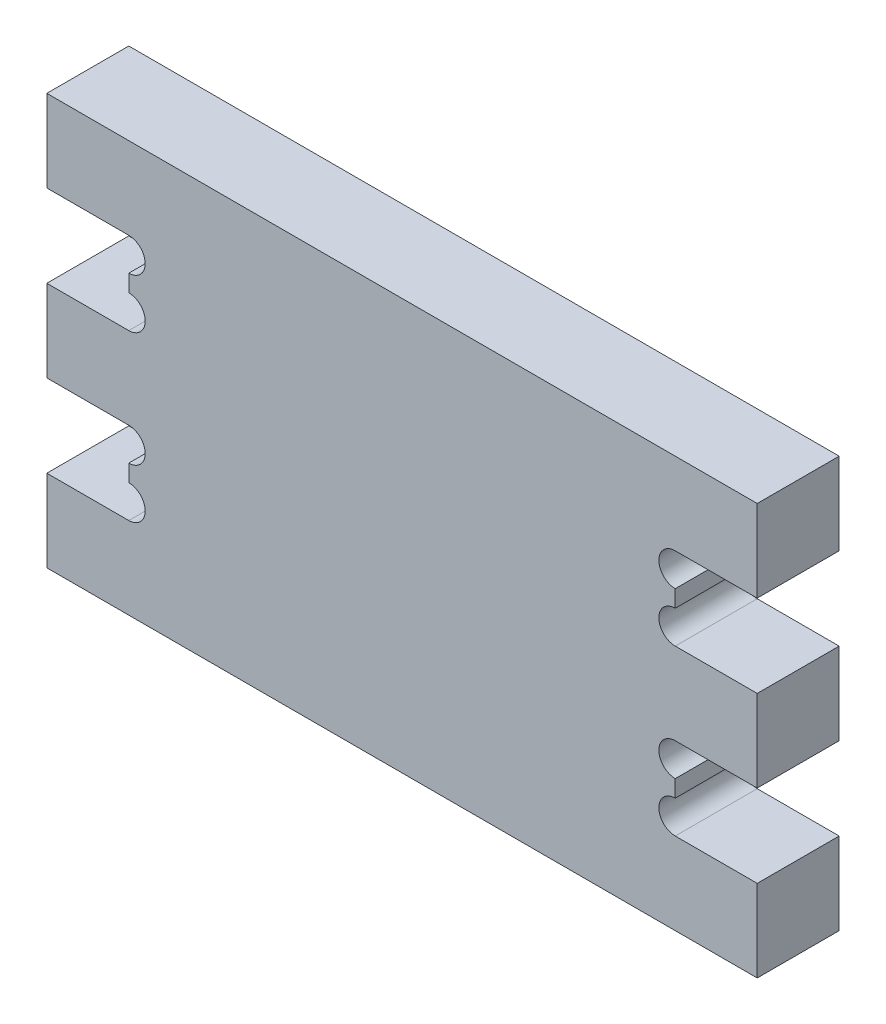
ISO-10303-21;
HEADER;
FILE_DESCRIPTION(('STEP AP214'),'2;1');
FILE_NAME('part.step','',(''),(''),'','','');
FILE_SCHEMA(('AUTOMOTIVE_DESIGN { 1 0 10303 214 1 1 1 1 }'));
ENDSEC;
DATA;
#1=APPLICATION_CONTEXT('core data for automotive mechanical design processes');
#2=APPLICATION_PROTOCOL_DEFINITION('international standard','automotive_design',2000,#1);
#3=PRODUCT_CONTEXT('',#1,'mechanical');
#4=PRODUCT('Part','Part','',(#3));
#5=PRODUCT_RELATED_PRODUCT_CATEGORY('part','',(#4));
#6=PRODUCT_DEFINITION_FORMATION('','',#4);
#7=PRODUCT_DEFINITION_CONTEXT('part definition',#1,'design');
#8=PRODUCT_DEFINITION('design','',#6,#7);
#9=PRODUCT_DEFINITION_SHAPE('','',#8);
#10=(LENGTH_UNIT() NAMED_UNIT(*) SI_UNIT(.MILLI.,.METRE.));
#11=(NAMED_UNIT(*) PLANE_ANGLE_UNIT() SI_UNIT($,.RADIAN.));
#12=(NAMED_UNIT(*) SI_UNIT($,.STERADIAN.) SOLID_ANGLE_UNIT());
#13=UNCERTAINTY_MEASURE_WITH_UNIT(LENGTH_MEASURE(1.E-05),#10,'distance_accuracy_value','');
#14=(GEOMETRIC_REPRESENTATION_CONTEXT(3) GLOBAL_UNCERTAINTY_ASSIGNED_CONTEXT((#13)) GLOBAL_UNIT_ASSIGNED_CONTEXT((#10,
#11,#12)) REPRESENTATION_CONTEXT('',''));
#15=CARTESIAN_POINT('',(0.,0.,0.));
#16=DIRECTION('',(0.,0.,1.));
#17=DIRECTION('',(1.,0.,0.));
#18=AXIS2_PLACEMENT_3D('',#15,#16,#17);
#19=CARTESIAN_POINT('',(0.,82.6,15.));
#20=DIRECTION('',(1.,0.,0.));
#21=DIRECTION('',(0.,1.,0.));
#22=AXIS2_PLACEMENT_3D('',#19,#20,#21);
#23=PLANE('',#22);
#24=DIRECTION('',(0.,-1.,0.));
#25=VECTOR('',#24,1.);
#26=CARTESIAN_POINT('',(0.,82.6,0.));
#27=LINE('',#26,#25);
#28=CARTESIAN_POINT('',(0.,82.6,0.));
#29=VERTEX_POINT('',#28);
#30=CARTESIAN_POINT('',(0.,67.6,0.));
#31=VERTEX_POINT('',#30);
#32=EDGE_CURVE('E258',#29,#31,#27,.T.);
#33=ORIENTED_EDGE('',*,*,#32,.T.);
#34=DIRECTION('',(0.,0.,-1.));
#35=VECTOR('',#34,1.);
#36=CARTESIAN_POINT('',(0.,67.6,15.));
#37=LINE('',#36,#35);
#38=CARTESIAN_POINT('',(0.,67.6,15.));
#39=VERTEX_POINT('',#38);
#40=EDGE_CURVE('E45',#39,#31,#37,.T.);
#41=ORIENTED_EDGE('',*,*,#40,.F.);
#42=DIRECTION('',(0.,-1.,0.));
#43=VECTOR('',#42,1.);
#44=CARTESIAN_POINT('',(0.,82.6,15.));
#45=LINE('',#44,#43);
#46=CARTESIAN_POINT('',(0.,82.6,15.));
#47=VERTEX_POINT('',#46);
#48=EDGE_CURVE('E158',#47,#39,#45,.T.);
#49=ORIENTED_EDGE('',*,*,#48,.F.);
#50=DIRECTION('',(0.,0.,-1.));
#51=VECTOR('',#50,1.);
#52=CARTESIAN_POINT('',(0.,82.6,15.));
#53=LINE('',#52,#51);
#54=EDGE_CURVE('E11',#47,#29,#53,.T.);
#55=ORIENTED_EDGE('',*,*,#54,.T.);
#56=EDGE_LOOP('',(#33,#41,#49,#55));
#57=FACE_BOUND('',#56,.T.);
#58=ADVANCED_FACE('F37',(#57),#23,.F.);
#59=CARTESIAN_POINT('',(0.,67.6,15.));
#60=DIRECTION('',(0.,1.,0.));
#61=DIRECTION('',(-1.,0.,0.));
#62=AXIS2_PLACEMENT_3D('',#59,#60,#61);
#63=PLANE('',#62);
#64=DIRECTION('',(1.,0.,0.));
#65=VECTOR('',#64,1.);
#66=CARTESIAN_POINT('',(0.,67.6,0.));
#67=LINE('',#66,#65);
#68=CARTESIAN_POINT('',(15.,67.6,0.));
#69=VERTEX_POINT('',#68);
#70=EDGE_CURVE('E260',#31,#69,#67,.T.);
#71=ORIENTED_EDGE('',*,*,#70,.T.);
#72=DIRECTION('',(0.,0.,-1.));
#73=VECTOR('',#72,1.);
#74=CARTESIAN_POINT('',(15.,67.6,15.));
#75=LINE('',#74,#73);
#76=CARTESIAN_POINT('',(15.,67.6,15.));
#77=VERTEX_POINT('',#76);
#78=EDGE_CURVE('E378',#77,#69,#75,.T.);
#79=ORIENTED_EDGE('',*,*,#78,.F.);
#80=DIRECTION('',(1.,0.,0.));
#81=VECTOR('',#80,1.);
#82=CARTESIAN_POINT('',(0.,67.6,15.));
#83=LINE('',#82,#81);
#84=EDGE_CURVE('E386',#39,#77,#83,.T.);
#85=ORIENTED_EDGE('',*,*,#84,.F.);
#86=ORIENTED_EDGE('',*,*,#40,.T.);
#87=EDGE_LOOP('',(#71,#79,#85,#86));
#88=FACE_BOUND('',#87,.T.);
#89=ADVANCED_FACE('F384',(#88),#63,.F.);
#90=CARTESIAN_POINT('',(15.,64.6,15.));
#91=DIRECTION('',(0.,0.,-1.));
#92=DIRECTION('',(-1.,0.,0.));
#93=AXIS2_PLACEMENT_3D('',#90,#91,#92);
#94=CYLINDRICAL_SURFACE('',#93,3.);
#95=CARTESIAN_POINT('',(15.,64.6,0.));
#96=DIRECTION('',(0.,0.,-1.));
#97=DIRECTION('',(-1.,0.,0.));
#98=AXIS2_PLACEMENT_3D('',#95,#96,#97);
#99=CIRCLE('',#98,3.);
#100=CARTESIAN_POINT('',(15.,61.6,0.));
#101=VERTEX_POINT('',#100);
#102=EDGE_CURVE('E262',#69,#101,#99,.T.);
#103=ORIENTED_EDGE('',*,*,#102,.T.);
#104=DIRECTION('',(0.,0.,-1.));
#105=VECTOR('',#104,1.);
#106=CARTESIAN_POINT('',(15.,61.6,15.));
#107=LINE('',#106,#105);
#108=CARTESIAN_POINT('',(15.,61.6,15.));
#109=VERTEX_POINT('',#108);
#110=EDGE_CURVE('E375',#109,#101,#107,.T.);
#111=ORIENTED_EDGE('',*,*,#110,.F.);
#112=CARTESIAN_POINT('',(15.,64.6,15.));
#113=DIRECTION('',(0.,0.,-1.));
#114=DIRECTION('',(-1.,0.,0.));
#115=AXIS2_PLACEMENT_3D('',#112,#113,#114);
#116=CIRCLE('',#115,3.);
#117=EDGE_CURVE('E402',#77,#109,#116,.T.);
#118=ORIENTED_EDGE('',*,*,#117,.F.);
#119=ORIENTED_EDGE('',*,*,#78,.T.);
#120=EDGE_LOOP('',(#103,#111,#118,#119));
#121=FACE_BOUND('',#120,.T.);
#122=ADVANCED_FACE('F393',(#121),#94,.F.);
#123=CARTESIAN_POINT('',(15.,61.6,15.));
#124=DIRECTION('',(1.,0.,0.));
#125=DIRECTION('',(0.,1.,0.));
#126=AXIS2_PLACEMENT_3D('',#123,#124,#125);
#127=PLANE('',#126);
#128=DIRECTION('',(0.,-1.,0.));
#129=VECTOR('',#128,1.);
#130=CARTESIAN_POINT('',(15.,61.6,0.));
#131=LINE('',#130,#129);
#132=CARTESIAN_POINT('',(15.,58.5,0.));
#133=VERTEX_POINT('',#132);
#134=EDGE_CURVE('E264',#101,#133,#131,.T.);
#135=ORIENTED_EDGE('',*,*,#134,.T.);
#136=DIRECTION('',(0.,0.,-1.));
#137=VECTOR('',#136,1.);
#138=CARTESIAN_POINT('',(15.,58.5,15.));
#139=LINE('',#138,#137);
#140=CARTESIAN_POINT('',(15.,58.5,15.));
#141=VERTEX_POINT('',#140);
#142=EDGE_CURVE('E372',#141,#133,#139,.T.);
#143=ORIENTED_EDGE('',*,*,#142,.F.);
#144=DIRECTION('',(0.,-1.,0.));
#145=VECTOR('',#144,1.);
#146=CARTESIAN_POINT('',(15.,61.6,15.));
#147=LINE('',#146,#145);
#148=EDGE_CURVE('E399',#109,#141,#147,.T.);
#149=ORIENTED_EDGE('',*,*,#148,.F.);
#150=ORIENTED_EDGE('',*,*,#110,.T.);
#151=EDGE_LOOP('',(#135,#143,#149,#150));
#152=FACE_BOUND('',#151,.T.);
#153=ADVANCED_FACE('F397',(#152),#127,.F.);
#154=CARTESIAN_POINT('',(15.,55.5,15.));
#155=DIRECTION('',(0.,0.,-1.));
#156=DIRECTION('',(-1.,0.,0.));
#157=AXIS2_PLACEMENT_3D('',#154,#155,#156);
#158=CYLINDRICAL_SURFACE('',#157,3.00000000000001);
#159=CARTESIAN_POINT('',(15.,55.5,0.));
#160=DIRECTION('',(0.,0.,-1.));
#161=DIRECTION('',(-1.,0.,0.));
#162=AXIS2_PLACEMENT_3D('',#159,#160,#161);
#163=CIRCLE('',#162,3.00000000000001);
#164=CARTESIAN_POINT('',(15.,52.5,0.));
#165=VERTEX_POINT('',#164);
#166=EDGE_CURVE('E266',#133,#165,#163,.T.);
#167=ORIENTED_EDGE('',*,*,#166,.T.);
#168=DIRECTION('',(0.,0.,-1.));
#169=VECTOR('',#168,1.);
#170=CARTESIAN_POINT('',(15.,52.5,15.));
#171=LINE('',#170,#169);
#172=CARTESIAN_POINT('',(15.,52.5,15.));
#173=VERTEX_POINT('',#172);
#174=EDGE_CURVE('E369',#173,#165,#171,.T.);
#175=ORIENTED_EDGE('',*,*,#174,.F.);
#176=CARTESIAN_POINT('',(15.,55.5,15.));
#177=DIRECTION('',(0.,0.,-1.));
#178=DIRECTION('',(-1.,0.,0.));
#179=AXIS2_PLACEMENT_3D('',#176,#177,#178);
#180=CIRCLE('',#179,3.00000000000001);
#181=EDGE_CURVE('E401',#141,#173,#180,.T.);
#182=ORIENTED_EDGE('',*,*,#181,.F.);
#183=ORIENTED_EDGE('',*,*,#142,.T.);
#184=EDGE_LOOP('',(#167,#175,#182,#183));
#185=FACE_BOUND('',#184,.T.);
#186=ADVANCED_FACE('F468',(#185),#158,.F.);
#187=CARTESIAN_POINT('',(15.,52.5,15.));
#188=DIRECTION('',(0.,-1.,0.));
#189=DIRECTION('',(0.,0.,-1.));
#190=AXIS2_PLACEMENT_3D('',#187,#188,#189);
#191=PLANE('',#190);
#192=DIRECTION('',(-1.,0.,0.));
#193=VECTOR('',#192,1.);
#194=CARTESIAN_POINT('',(15.,52.5,0.));
#195=LINE('',#194,#193);
#196=CARTESIAN_POINT('',(0.,52.5,0.));
#197=VERTEX_POINT('',#196);
#198=EDGE_CURVE('E268',#165,#197,#195,.T.);
#199=ORIENTED_EDGE('',*,*,#198,.T.);
#200=DIRECTION('',(0.,0.,-1.));
#201=VECTOR('',#200,1.);
#202=CARTESIAN_POINT('',(0.,52.5,15.));
#203=LINE('',#202,#201);
#204=CARTESIAN_POINT('',(0.,52.5,15.));
#205=VERTEX_POINT('',#204);
#206=EDGE_CURVE('E366',#205,#197,#203,.T.);
#207=ORIENTED_EDGE('',*,*,#206,.F.);
#208=DIRECTION('',(-1.,0.,0.));
#209=VECTOR('',#208,1.);
#210=CARTESIAN_POINT('',(15.,52.5,15.));
#211=LINE('',#210,#209);
#212=EDGE_CURVE('E404',#173,#205,#211,.T.);
#213=ORIENTED_EDGE('',*,*,#212,.F.);
#214=ORIENTED_EDGE('',*,*,#174,.T.);
#215=EDGE_LOOP('',(#199,#207,#213,#214));
#216=FACE_BOUND('',#215,.T.);
#217=ADVANCED_FACE('F471',(#216),#191,.F.);
#218=CARTESIAN_POINT('',(0.,52.5,15.));
#219=DIRECTION('',(1.,0.,0.));
#220=DIRECTION('',(0.,1.,0.));
#221=AXIS2_PLACEMENT_3D('',#218,#219,#220);
#222=PLANE('',#221);
#223=DIRECTION('',(0.,-1.,0.));
#224=VECTOR('',#223,1.);
#225=CARTESIAN_POINT('',(0.,52.5,0.));
#226=LINE('',#225,#224);
#227=CARTESIAN_POINT('',(0.,37.5,0.));
#228=VERTEX_POINT('',#227);
#229=EDGE_CURVE('E270',#197,#228,#226,.T.);
#230=ORIENTED_EDGE('',*,*,#229,.T.);
#231=DIRECTION('',(0.,0.,-1.));
#232=VECTOR('',#231,1.);
#233=CARTESIAN_POINT('',(0.,37.5,15.));
#234=LINE('',#233,#232);
#235=CARTESIAN_POINT('',(0.,37.5,15.));
#236=VERTEX_POINT('',#235);
#237=EDGE_CURVE('E363',#236,#228,#234,.T.);
#238=ORIENTED_EDGE('',*,*,#237,.F.);
#239=DIRECTION('',(0.,-1.,0.));
#240=VECTOR('',#239,1.);
#241=CARTESIAN_POINT('',(0.,52.5,15.));
#242=LINE('',#241,#240);
#243=EDGE_CURVE('E410',#205,#236,#242,.T.);
#244=ORIENTED_EDGE('',*,*,#243,.F.);
#245=ORIENTED_EDGE('',*,*,#206,.T.);
#246=EDGE_LOOP('',(#230,#238,#244,#245));
#247=FACE_BOUND('',#246,.T.);
#248=ADVANCED_FACE('F475',(#247),#222,.F.);
#249=CARTESIAN_POINT('',(0.,37.5,15.));
#250=DIRECTION('',(0.,1.,0.));
#251=DIRECTION('',(-1.,0.,0.));
#252=AXIS2_PLACEMENT_3D('',#249,#250,#251);
#253=PLANE('',#252);
#254=DIRECTION('',(1.,0.,0.));
#255=VECTOR('',#254,1.);
#256=CARTESIAN_POINT('',(0.,37.5,0.));
#257=LINE('',#256,#255);
#258=CARTESIAN_POINT('',(15.,37.5,0.));
#259=VERTEX_POINT('',#258);
#260=EDGE_CURVE('E272',#228,#259,#257,.T.);
#261=ORIENTED_EDGE('',*,*,#260,.T.);
#262=DIRECTION('',(0.,0.,-1.));
#263=VECTOR('',#262,1.);
#264=CARTESIAN_POINT('',(15.,37.5,15.));
#265=LINE('',#264,#263);
#266=CARTESIAN_POINT('',(15.,37.5,15.));
#267=VERTEX_POINT('',#266);
#268=EDGE_CURVE('E360',#267,#259,#265,.T.);
#269=ORIENTED_EDGE('',*,*,#268,.F.);
#270=DIRECTION('',(1.,0.,0.));
#271=VECTOR('',#270,1.);
#272=CARTESIAN_POINT('',(0.,37.5,15.));
#273=LINE('',#272,#271);
#274=EDGE_CURVE('E412',#236,#267,#273,.T.);
#275=ORIENTED_EDGE('',*,*,#274,.F.);
#276=ORIENTED_EDGE('',*,*,#237,.T.);
#277=EDGE_LOOP('',(#261,#269,#275,#276));
#278=FACE_BOUND('',#277,.T.);
#279=ADVANCED_FACE('F479',(#278),#253,.F.);
#280=CARTESIAN_POINT('',(15.,34.5,15.));
#281=DIRECTION('',(0.,0.,-1.));
#282=DIRECTION('',(-1.,0.,0.));
#283=AXIS2_PLACEMENT_3D('',#280,#281,#282);
#284=CYLINDRICAL_SURFACE('',#283,3.);
#285=CARTESIAN_POINT('',(15.,34.5,0.));
#286=DIRECTION('',(0.,0.,-1.));
#287=DIRECTION('',(-1.,0.,0.));
#288=AXIS2_PLACEMENT_3D('',#285,#286,#287);
#289=CIRCLE('',#288,3.);
#290=CARTESIAN_POINT('',(15.,31.5,0.));
#291=VERTEX_POINT('',#290);
#292=EDGE_CURVE('E274',#259,#291,#289,.T.);
#293=ORIENTED_EDGE('',*,*,#292,.T.);
#294=DIRECTION('',(0.,0.,-1.));
#295=VECTOR('',#294,1.);
#296=CARTESIAN_POINT('',(15.,31.5,15.));
#297=LINE('',#296,#295);
#298=CARTESIAN_POINT('',(15.,31.5,15.));
#299=VERTEX_POINT('',#298);
#300=EDGE_CURVE('E357',#299,#291,#297,.T.);
#301=ORIENTED_EDGE('',*,*,#300,.F.);
#302=CARTESIAN_POINT('',(15.,34.5,15.));
#303=DIRECTION('',(0.,0.,-1.));
#304=DIRECTION('',(-1.,0.,0.));
#305=AXIS2_PLACEMENT_3D('',#302,#303,#304);
#306=CIRCLE('',#305,3.);
#307=EDGE_CURVE('E414',#267,#299,#306,.T.);
#308=ORIENTED_EDGE('',*,*,#307,.F.);
#309=ORIENTED_EDGE('',*,*,#268,.T.);
#310=EDGE_LOOP('',(#293,#301,#308,#309));
#311=FACE_BOUND('',#310,.T.);
#312=ADVANCED_FACE('F483',(#311),#284,.F.);
#313=CARTESIAN_POINT('',(15.,31.5,15.));
#314=DIRECTION('',(1.,0.,0.));
#315=DIRECTION('',(0.,1.,0.));
#316=AXIS2_PLACEMENT_3D('',#313,#314,#315);
#317=PLANE('',#316);
#318=DIRECTION('',(0.,-1.,0.));
#319=VECTOR('',#318,1.);
#320=CARTESIAN_POINT('',(15.,31.5,0.));
#321=LINE('',#320,#319);
#322=CARTESIAN_POINT('',(15.,28.4,0.));
#323=VERTEX_POINT('',#322);
#324=EDGE_CURVE('E276',#291,#323,#321,.T.);
#325=ORIENTED_EDGE('',*,*,#324,.T.);
#326=DIRECTION('',(0.,0.,-1.));
#327=VECTOR('',#326,1.);
#328=CARTESIAN_POINT('',(15.,28.4,15.));
#329=LINE('',#328,#327);
#330=CARTESIAN_POINT('',(15.,28.4,15.));
#331=VERTEX_POINT('',#330);
#332=EDGE_CURVE('E354',#331,#323,#329,.T.);
#333=ORIENTED_EDGE('',*,*,#332,.F.);
#334=DIRECTION('',(0.,-1.,0.));
#335=VECTOR('',#334,1.);
#336=CARTESIAN_POINT('',(15.,31.5,15.));
#337=LINE('',#336,#335);
#338=EDGE_CURVE('E416',#299,#331,#337,.T.);
#339=ORIENTED_EDGE('',*,*,#338,.F.);
#340=ORIENTED_EDGE('',*,*,#300,.T.);
#341=EDGE_LOOP('',(#325,#333,#339,#340));
#342=FACE_BOUND('',#341,.T.);
#343=ADVANCED_FACE('F487',(#342),#317,.F.);
#344=CARTESIAN_POINT('',(15.,25.4,15.));
#345=DIRECTION('',(0.,0.,-1.));
#346=DIRECTION('',(-1.,0.,0.));
#347=AXIS2_PLACEMENT_3D('',#344,#345,#346);
#348=CYLINDRICAL_SURFACE('',#347,3.);
#349=CARTESIAN_POINT('',(15.,25.4,0.));
#350=DIRECTION('',(0.,0.,-1.));
#351=DIRECTION('',(-1.,0.,0.));
#352=AXIS2_PLACEMENT_3D('',#349,#350,#351);
#353=CIRCLE('',#352,3.);
#354=CARTESIAN_POINT('',(15.,22.4,0.));
#355=VERTEX_POINT('',#354);
#356=EDGE_CURVE('E278',#323,#355,#353,.T.);
#357=ORIENTED_EDGE('',*,*,#356,.T.);
#358=DIRECTION('',(0.,0.,-1.));
#359=VECTOR('',#358,1.);
#360=CARTESIAN_POINT('',(15.,22.4,15.));
#361=LINE('',#360,#359);
#362=CARTESIAN_POINT('',(15.,22.4,15.));
#363=VERTEX_POINT('',#362);
#364=EDGE_CURVE('E351',#363,#355,#361,.T.);
#365=ORIENTED_EDGE('',*,*,#364,.F.);
#366=CARTESIAN_POINT('',(15.,25.4,15.));
#367=DIRECTION('',(0.,0.,-1.));
#368=DIRECTION('',(-1.,0.,0.));
#369=AXIS2_PLACEMENT_3D('',#366,#367,#368);
#370=CIRCLE('',#369,3.);
#371=EDGE_CURVE('E418',#331,#363,#370,.T.);
#372=ORIENTED_EDGE('',*,*,#371,.F.);
#373=ORIENTED_EDGE('',*,*,#332,.T.);
#374=EDGE_LOOP('',(#357,#365,#372,#373));
#375=FACE_BOUND('',#374,.T.);
#376=ADVANCED_FACE('F491',(#375),#348,.F.);
#377=CARTESIAN_POINT('',(15.,22.4,15.));
#378=DIRECTION('',(0.,-1.,0.));
#379=DIRECTION('',(1.,0.,0.));
#380=AXIS2_PLACEMENT_3D('',#377,#378,#379);
#381=PLANE('',#380);
#382=DIRECTION('',(-1.,0.,0.));
#383=VECTOR('',#382,1.);
#384=CARTESIAN_POINT('',(15.,22.4,0.));
#385=LINE('',#384,#383);
#386=CARTESIAN_POINT('',(0.,22.4,0.));
#387=VERTEX_POINT('',#386);
#388=EDGE_CURVE('E280',#355,#387,#385,.T.);
#389=ORIENTED_EDGE('',*,*,#388,.T.);
#390=DIRECTION('',(0.,0.,-1.));
#391=VECTOR('',#390,1.);
#392=CARTESIAN_POINT('',(0.,22.4,15.));
#393=LINE('',#392,#391);
#394=CARTESIAN_POINT('',(0.,22.4,15.));
#395=VERTEX_POINT('',#394);
#396=EDGE_CURVE('E348',#395,#387,#393,.T.);
#397=ORIENTED_EDGE('',*,*,#396,.F.);
#398=DIRECTION('',(-1.,0.,0.));
#399=VECTOR('',#398,1.);
#400=CARTESIAN_POINT('',(15.,22.4,15.));
#401=LINE('',#400,#399);
#402=EDGE_CURVE('E420',#363,#395,#401,.T.);
#403=ORIENTED_EDGE('',*,*,#402,.F.);
#404=ORIENTED_EDGE('',*,*,#364,.T.);
#405=EDGE_LOOP('',(#389,#397,#403,#404));
#406=FACE_BOUND('',#405,.T.);
#407=ADVANCED_FACE('F495',(#406),#381,.F.);
#408=CARTESIAN_POINT('',(0.,22.4,15.));
#409=DIRECTION('',(1.,0.,0.));
#410=DIRECTION('',(0.,1.,0.));
#411=AXIS2_PLACEMENT_3D('',#408,#409,#410);
#412=PLANE('',#411);
#413=DIRECTION('',(0.,-1.,0.));
#414=VECTOR('',#413,1.);
#415=CARTESIAN_POINT('',(0.,22.4,0.));
#416=LINE('',#415,#414);
#417=CARTESIAN_POINT('',(0.,7.4,0.));
#418=VERTEX_POINT('',#417);
#419=EDGE_CURVE('E282',#387,#418,#416,.T.);
#420=ORIENTED_EDGE('',*,*,#419,.T.);
#421=DIRECTION('',(0.,0.,-1.));
#422=VECTOR('',#421,1.);
#423=CARTESIAN_POINT('',(0.,7.4,15.));
#424=LINE('',#423,#422);
#425=CARTESIAN_POINT('',(0.,7.4,15.));
#426=VERTEX_POINT('',#425);
#427=EDGE_CURVE('E345',#426,#418,#424,.T.);
#428=ORIENTED_EDGE('',*,*,#427,.F.);
#429=DIRECTION('',(0.,-1.,0.));
#430=VECTOR('',#429,1.);
#431=CARTESIAN_POINT('',(0.,22.4,15.));
#432=LINE('',#431,#430);
#433=EDGE_CURVE('E422',#395,#426,#432,.T.);
#434=ORIENTED_EDGE('',*,*,#433,.F.);
#435=ORIENTED_EDGE('',*,*,#396,.T.);
#436=EDGE_LOOP('',(#420,#428,#434,#435));
#437=FACE_BOUND('',#436,.T.);
#438=ADVANCED_FACE('F499',(#437),#412,.F.);
#439=CARTESIAN_POINT('',(130.,7.40000000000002,15.));
#440=DIRECTION('',(0.,1.,0.));
#441=DIRECTION('',(-1.,0.,0.));
#442=AXIS2_PLACEMENT_3D('',#439,#440,#441);
#443=PLANE('',#442);
#444=DIRECTION('',(1.,0.,0.));
#445=VECTOR('',#444,1.);
#446=CARTESIAN_POINT('',(130.,7.40000000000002,0.));
#447=LINE('',#446,#445);
#448=CARTESIAN_POINT('',(130.,7.40000000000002,0.));
#449=VERTEX_POINT('',#448);
#450=EDGE_CURVE('E285',#418,#449,#447,.T.);
#451=ORIENTED_EDGE('',*,*,#450,.T.);
#452=DIRECTION('',(0.,0.,-1.));
#453=VECTOR('',#452,1.);
#454=CARTESIAN_POINT('',(130.,7.40000000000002,15.));
#455=LINE('',#454,#453);
#456=CARTESIAN_POINT('',(130.,7.40000000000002,15.));
#457=VERTEX_POINT('',#456);
#458=EDGE_CURVE('E342',#457,#449,#455,.T.);
#459=ORIENTED_EDGE('',*,*,#458,.F.);
#460=DIRECTION('',(1.,0.,0.));
#461=VECTOR('',#460,1.);
#462=CARTESIAN_POINT('',(0.,7.4,15.));
#463=LINE('',#462,#461);
#464=EDGE_CURVE('E424',#426,#457,#463,.T.);
#465=ORIENTED_EDGE('',*,*,#464,.F.);
#466=ORIENTED_EDGE('',*,*,#427,.T.);
#467=EDGE_LOOP('',(#451,#459,#465,#466));
#468=FACE_BOUND('',#467,.T.);
#469=ADVANCED_FACE('F503',(#468),#443,.F.);
#470=CARTESIAN_POINT('',(130.,22.4,15.));
#471=DIRECTION('',(-1.,0.,0.));
#472=DIRECTION('',(0.,0.,1.));
#473=AXIS2_PLACEMENT_3D('',#470,#471,#472);
#474=PLANE('',#473);
#475=DIRECTION('',(0.,1.,0.));
#476=VECTOR('',#475,1.);
#477=CARTESIAN_POINT('',(130.,22.4,0.));
#478=LINE('',#477,#476);
#479=CARTESIAN_POINT('',(130.,22.4,0.));
#480=VERTEX_POINT('',#479);
#481=EDGE_CURVE('E287',#449,#480,#478,.T.);
#482=ORIENTED_EDGE('',*,*,#481,.T.);
#483=DIRECTION('',(0.,0.,-1.));
#484=VECTOR('',#483,1.);
#485=CARTESIAN_POINT('',(130.,22.4,15.));
#486=LINE('',#485,#484);
#487=CARTESIAN_POINT('',(130.,22.4,15.));
#488=VERTEX_POINT('',#487);
#489=EDGE_CURVE('E339',#488,#480,#486,.T.);
#490=ORIENTED_EDGE('',*,*,#489,.F.);
#491=DIRECTION('',(0.,1.,0.));
#492=VECTOR('',#491,1.);
#493=CARTESIAN_POINT('',(130.,22.4,15.));
#494=LINE('',#493,#492);
#495=EDGE_CURVE('E426',#457,#488,#494,.T.);
#496=ORIENTED_EDGE('',*,*,#495,.F.);
#497=ORIENTED_EDGE('',*,*,#458,.T.);
#498=EDGE_LOOP('',(#482,#490,#496,#497));
#499=FACE_BOUND('',#498,.T.);
#500=ADVANCED_FACE('F507',(#499),#474,.F.);
#501=CARTESIAN_POINT('',(115.,22.4,15.));
#502=DIRECTION('',(0.,-1.,0.));
#503=DIRECTION('',(1.,0.,0.));
#504=AXIS2_PLACEMENT_3D('',#501,#502,#503);
#505=PLANE('',#504);
#506=DIRECTION('',(-1.,0.,0.));
#507=VECTOR('',#506,1.);
#508=CARTESIAN_POINT('',(115.,22.4,0.));
#509=LINE('',#508,#507);
#510=CARTESIAN_POINT('',(115.,22.4,0.));
#511=VERTEX_POINT('',#510);
#512=EDGE_CURVE('E289',#480,#511,#509,.T.);
#513=ORIENTED_EDGE('',*,*,#512,.T.);
#514=DIRECTION('',(0.,0.,-1.));
#515=VECTOR('',#514,1.);
#516=CARTESIAN_POINT('',(115.,22.4,15.));
#517=LINE('',#516,#515);
#518=CARTESIAN_POINT('',(115.,22.4,15.));
#519=VERTEX_POINT('',#518);
#520=EDGE_CURVE('E336',#519,#511,#517,.T.);
#521=ORIENTED_EDGE('',*,*,#520,.F.);
#522=DIRECTION('',(-1.,0.,0.));
#523=VECTOR('',#522,1.);
#524=CARTESIAN_POINT('',(115.,22.4,15.));
#525=LINE('',#524,#523);
#526=EDGE_CURVE('E428',#488,#519,#525,.T.);
#527=ORIENTED_EDGE('',*,*,#526,.F.);
#528=ORIENTED_EDGE('',*,*,#489,.T.);
#529=EDGE_LOOP('',(#513,#521,#527,#528));
#530=FACE_BOUND('',#529,.T.);
#531=ADVANCED_FACE('F511',(#530),#505,.F.);
#532=CARTESIAN_POINT('',(115.,25.4,15.));
#533=DIRECTION('',(0.,0.,-1.));
#534=DIRECTION('',(-1.,0.,0.));
#535=AXIS2_PLACEMENT_3D('',#532,#533,#534);
#536=CYLINDRICAL_SURFACE('',#535,3.00000000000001);
#537=CARTESIAN_POINT('',(115.,25.4,0.));
#538=DIRECTION('',(0.,0.,-1.));
#539=DIRECTION('',(-1.,0.,0.));
#540=AXIS2_PLACEMENT_3D('',#537,#538,#539);
#541=CIRCLE('',#540,3.00000000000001);
#542=CARTESIAN_POINT('',(115.,28.4,0.));
#543=VERTEX_POINT('',#542);
#544=EDGE_CURVE('E291',#511,#543,#541,.T.);
#545=ORIENTED_EDGE('',*,*,#544,.T.);
#546=DIRECTION('',(0.,0.,-1.));
#547=VECTOR('',#546,1.);
#548=CARTESIAN_POINT('',(115.,28.4,15.));
#549=LINE('',#548,#547);
#550=CARTESIAN_POINT('',(115.,28.4,15.));
#551=VERTEX_POINT('',#550);
#552=EDGE_CURVE('E333',#551,#543,#549,.T.);
#553=ORIENTED_EDGE('',*,*,#552,.F.);
#554=CARTESIAN_POINT('',(115.,25.4,15.));
#555=DIRECTION('',(0.,0.,-1.));
#556=DIRECTION('',(-1.,0.,0.));
#557=AXIS2_PLACEMENT_3D('',#554,#555,#556);
#558=CIRCLE('',#557,3.00000000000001);
#559=EDGE_CURVE('E430',#519,#551,#558,.T.);
#560=ORIENTED_EDGE('',*,*,#559,.F.);
#561=ORIENTED_EDGE('',*,*,#520,.T.);
#562=EDGE_LOOP('',(#545,#553,#560,#561));
#563=FACE_BOUND('',#562,.T.);
#564=ADVANCED_FACE('F515',(#563),#536,.F.);
#565=CARTESIAN_POINT('',(115.,31.5,15.));
#566=DIRECTION('',(-1.,0.,0.));
#567=DIRECTION('',(0.,0.,1.));
#568=AXIS2_PLACEMENT_3D('',#565,#566,#567);
#569=PLANE('',#568);
#570=DIRECTION('',(0.,1.,0.));
#571=VECTOR('',#570,1.);
#572=CARTESIAN_POINT('',(115.,31.5,0.));
#573=LINE('',#572,#571);
#574=CARTESIAN_POINT('',(115.,31.5,0.));
#575=VERTEX_POINT('',#574);
#576=EDGE_CURVE('E293',#543,#575,#573,.T.);
#577=ORIENTED_EDGE('',*,*,#576,.T.);
#578=DIRECTION('',(0.,0.,-1.));
#579=VECTOR('',#578,1.);
#580=CARTESIAN_POINT('',(115.,31.5,15.));
#581=LINE('',#580,#579);
#582=CARTESIAN_POINT('',(115.,31.5,15.));
#583=VERTEX_POINT('',#582);
#584=EDGE_CURVE('E330',#583,#575,#581,.T.);
#585=ORIENTED_EDGE('',*,*,#584,.F.);
#586=DIRECTION('',(0.,1.,0.));
#587=VECTOR('',#586,1.);
#588=CARTESIAN_POINT('',(115.,31.5,15.));
#589=LINE('',#588,#587);
#590=EDGE_CURVE('E432',#551,#583,#589,.T.);
#591=ORIENTED_EDGE('',*,*,#590,.F.);
#592=ORIENTED_EDGE('',*,*,#552,.T.);
#593=EDGE_LOOP('',(#577,#585,#591,#592));
#594=FACE_BOUND('',#593,.T.);
#595=ADVANCED_FACE('F519',(#594),#569,.F.);
#596=CARTESIAN_POINT('',(115.,34.5,15.));
#597=DIRECTION('',(0.,0.,-1.));
#598=DIRECTION('',(-1.,0.,0.));
#599=AXIS2_PLACEMENT_3D('',#596,#597,#598);
#600=CYLINDRICAL_SURFACE('',#599,3.);
#601=CARTESIAN_POINT('',(115.,34.5,0.));
#602=DIRECTION('',(0.,0.,-1.));
#603=DIRECTION('',(-1.,0.,0.));
#604=AXIS2_PLACEMENT_3D('',#601,#602,#603);
#605=CIRCLE('',#604,3.);
#606=CARTESIAN_POINT('',(115.,37.5,0.));
#607=VERTEX_POINT('',#606);
#608=EDGE_CURVE('E295',#575,#607,#605,.T.);
#609=ORIENTED_EDGE('',*,*,#608,.T.);
#610=DIRECTION('',(0.,0.,-1.));
#611=VECTOR('',#610,1.);
#612=CARTESIAN_POINT('',(115.,37.5,15.));
#613=LINE('',#612,#611);
#614=CARTESIAN_POINT('',(115.,37.5,15.));
#615=VERTEX_POINT('',#614);
#616=EDGE_CURVE('E327',#615,#607,#613,.T.);
#617=ORIENTED_EDGE('',*,*,#616,.F.);
#618=CARTESIAN_POINT('',(115.,34.5,15.));
#619=DIRECTION('',(0.,0.,-1.));
#620=DIRECTION('',(-1.,0.,0.));
#621=AXIS2_PLACEMENT_3D('',#618,#619,#620);
#622=CIRCLE('',#621,3.);
#623=EDGE_CURVE('E434',#583,#615,#622,.T.);
#624=ORIENTED_EDGE('',*,*,#623,.F.);
#625=ORIENTED_EDGE('',*,*,#584,.T.);
#626=EDGE_LOOP('',(#609,#617,#624,#625));
#627=FACE_BOUND('',#626,.T.);
#628=ADVANCED_FACE('F523',(#627),#600,.F.);
#629=CARTESIAN_POINT('',(130.,37.5,15.));
#630=DIRECTION('',(0.,1.,0.));
#631=DIRECTION('',(-1.,0.,0.));
#632=AXIS2_PLACEMENT_3D('',#629,#630,#631);
#633=PLANE('',#632);
#634=DIRECTION('',(1.,0.,0.));
#635=VECTOR('',#634,1.);
#636=CARTESIAN_POINT('',(130.,37.5,0.));
#637=LINE('',#636,#635);
#638=CARTESIAN_POINT('',(130.,37.5,0.));
#639=VERTEX_POINT('',#638);
#640=EDGE_CURVE('E297',#607,#639,#637,.T.);
#641=ORIENTED_EDGE('',*,*,#640,.T.);
#642=DIRECTION('',(0.,0.,-1.));
#643=VECTOR('',#642,1.);
#644=CARTESIAN_POINT('',(130.,37.5,15.));
#645=LINE('',#644,#643);
#646=CARTESIAN_POINT('',(130.,37.5,15.));
#647=VERTEX_POINT('',#646);
#648=EDGE_CURVE('E324',#647,#639,#645,.T.);
#649=ORIENTED_EDGE('',*,*,#648,.F.);
#650=DIRECTION('',(1.,0.,0.));
#651=VECTOR('',#650,1.);
#652=CARTESIAN_POINT('',(130.,37.5,15.));
#653=LINE('',#652,#651);
#654=EDGE_CURVE('E436',#615,#647,#653,.T.);
#655=ORIENTED_EDGE('',*,*,#654,.F.);
#656=ORIENTED_EDGE('',*,*,#616,.T.);
#657=EDGE_LOOP('',(#641,#649,#655,#656));
#658=FACE_BOUND('',#657,.T.);
#659=ADVANCED_FACE('F527',(#658),#633,.F.);
#660=CARTESIAN_POINT('',(130.,52.5,15.));
#661=DIRECTION('',(-1.,0.,0.));
#662=DIRECTION('',(0.,-1.,0.));
#663=AXIS2_PLACEMENT_3D('',#660,#661,#662);
#664=PLANE('',#663);
#665=DIRECTION('',(0.,1.,0.));
#666=VECTOR('',#665,1.);
#667=CARTESIAN_POINT('',(130.,52.5,0.));
#668=LINE('',#667,#666);
#669=CARTESIAN_POINT('',(130.,52.5,0.));
#670=VERTEX_POINT('',#669);
#671=EDGE_CURVE('E299',#639,#670,#668,.T.);
#672=ORIENTED_EDGE('',*,*,#671,.T.);
#673=DIRECTION('',(0.,0.,-1.));
#674=VECTOR('',#673,1.);
#675=CARTESIAN_POINT('',(130.,52.5,15.));
#676=LINE('',#675,#674);
#677=CARTESIAN_POINT('',(130.,52.5,15.));
#678=VERTEX_POINT('',#677);
#679=EDGE_CURVE('E321',#678,#670,#676,.T.);
#680=ORIENTED_EDGE('',*,*,#679,.F.);
#681=DIRECTION('',(0.,1.,0.));
#682=VECTOR('',#681,1.);
#683=CARTESIAN_POINT('',(130.,52.5,15.));
#684=LINE('',#683,#682);
#685=EDGE_CURVE('E438',#647,#678,#684,.T.);
#686=ORIENTED_EDGE('',*,*,#685,.F.);
#687=ORIENTED_EDGE('',*,*,#648,.T.);
#688=EDGE_LOOP('',(#672,#680,#686,#687));
#689=FACE_BOUND('',#688,.T.);
#690=ADVANCED_FACE('F531',(#689),#664,.F.);
#691=CARTESIAN_POINT('',(115.,52.5,15.));
#692=DIRECTION('',(0.,-1.,0.));
#693=DIRECTION('',(1.,0.,0.));
#694=AXIS2_PLACEMENT_3D('',#691,#692,#693);
#695=PLANE('',#694);
#696=DIRECTION('',(-1.,0.,0.));
#697=VECTOR('',#696,1.);
#698=CARTESIAN_POINT('',(115.,52.5,0.));
#699=LINE('',#698,#697);
#700=CARTESIAN_POINT('',(115.,52.5,0.));
#701=VERTEX_POINT('',#700);
#702=EDGE_CURVE('E301',#670,#701,#699,.T.);
#703=ORIENTED_EDGE('',*,*,#702,.T.);
#704=DIRECTION('',(0.,0.,-1.));
#705=VECTOR('',#704,1.);
#706=CARTESIAN_POINT('',(115.,52.5,15.));
#707=LINE('',#706,#705);
#708=CARTESIAN_POINT('',(115.,52.5,15.));
#709=VERTEX_POINT('',#708);
#710=EDGE_CURVE('E318',#709,#701,#707,.T.);
#711=ORIENTED_EDGE('',*,*,#710,.F.);
#712=DIRECTION('',(-1.,0.,0.));
#713=VECTOR('',#712,1.);
#714=CARTESIAN_POINT('',(115.,52.5,15.));
#715=LINE('',#714,#713);
#716=EDGE_CURVE('E440',#678,#709,#715,.T.);
#717=ORIENTED_EDGE('',*,*,#716,.F.);
#718=ORIENTED_EDGE('',*,*,#679,.T.);
#719=EDGE_LOOP('',(#703,#711,#717,#718));
#720=FACE_BOUND('',#719,.T.);
#721=ADVANCED_FACE('F535',(#720),#695,.F.);
#722=CARTESIAN_POINT('',(115.,55.5,15.));
#723=DIRECTION('',(0.,0.,-1.));
#724=DIRECTION('',(-1.,0.,0.));
#725=AXIS2_PLACEMENT_3D('',#722,#723,#724);
#726=CYLINDRICAL_SURFACE('',#725,3.);
#727=CARTESIAN_POINT('',(115.,55.5,0.));
#728=DIRECTION('',(0.,0.,-1.));
#729=DIRECTION('',(-1.,0.,0.));
#730=AXIS2_PLACEMENT_3D('',#727,#728,#729);
#731=CIRCLE('',#730,3.);
#732=CARTESIAN_POINT('',(115.,58.5,0.));
#733=VERTEX_POINT('',#732);
#734=EDGE_CURVE('E303',#701,#733,#731,.T.);
#735=ORIENTED_EDGE('',*,*,#734,.T.);
#736=DIRECTION('',(0.,0.,-1.));
#737=VECTOR('',#736,1.);
#738=CARTESIAN_POINT('',(115.,58.5,15.));
#739=LINE('',#738,#737);
#740=CARTESIAN_POINT('',(115.,58.5,15.));
#741=VERTEX_POINT('',#740);
#742=EDGE_CURVE('E315',#741,#733,#739,.T.);
#743=ORIENTED_EDGE('',*,*,#742,.F.);
#744=CARTESIAN_POINT('',(115.,55.5,15.));
#745=DIRECTION('',(0.,0.,-1.));
#746=DIRECTION('',(-1.,0.,0.));
#747=AXIS2_PLACEMENT_3D('',#744,#745,#746);
#748=CIRCLE('',#747,3.);
#749=EDGE_CURVE('E442',#709,#741,#748,.T.);
#750=ORIENTED_EDGE('',*,*,#749,.F.);
#751=ORIENTED_EDGE('',*,*,#710,.T.);
#752=EDGE_LOOP('',(#735,#743,#750,#751));
#753=FACE_BOUND('',#752,.T.);
#754=ADVANCED_FACE('F448',(#753),#726,.F.);
#755=CARTESIAN_POINT('',(115.,61.6,15.));
#756=DIRECTION('',(-1.,0.,0.));
#757=DIRECTION('',(0.,-1.,0.));
#758=AXIS2_PLACEMENT_3D('',#755,#756,#757);
#759=PLANE('',#758);
#760=DIRECTION('',(0.,1.,0.));
#761=VECTOR('',#760,1.);
#762=CARTESIAN_POINT('',(115.,61.6,0.));
#763=LINE('',#762,#761);
#764=CARTESIAN_POINT('',(115.,61.6,0.));
#765=VERTEX_POINT('',#764);
#766=EDGE_CURVE('E305',#733,#765,#763,.T.);
#767=ORIENTED_EDGE('',*,*,#766,.T.);
#768=DIRECTION('',(0.,0.,-1.));
#769=VECTOR('',#768,1.);
#770=CARTESIAN_POINT('',(115.,61.6,15.));
#771=LINE('',#770,#769);
#772=CARTESIAN_POINT('',(115.,61.6,15.));
#773=VERTEX_POINT('',#772);
#774=EDGE_CURVE('E247',#773,#765,#771,.T.);
#775=ORIENTED_EDGE('',*,*,#774,.F.);
#776=DIRECTION('',(0.,1.,0.));
#777=VECTOR('',#776,1.);
#778=CARTESIAN_POINT('',(115.,61.6,15.));
#779=LINE('',#778,#777);
#780=EDGE_CURVE('E238',#741,#773,#779,.T.);
#781=ORIENTED_EDGE('',*,*,#780,.F.);
#782=ORIENTED_EDGE('',*,*,#742,.T.);
#783=EDGE_LOOP('',(#767,#775,#781,#782));
#784=FACE_BOUND('',#783,.T.);
#785=ADVANCED_FACE('F452',(#784),#759,.F.);
#786=CARTESIAN_POINT('',(115.,64.6,15.));
#787=DIRECTION('',(0.,0.,-1.));
#788=DIRECTION('',(-1.,0.,0.));
#789=AXIS2_PLACEMENT_3D('',#786,#787,#788);
#790=CYLINDRICAL_SURFACE('',#789,3.);
#791=CARTESIAN_POINT('',(115.,64.6,0.));
#792=DIRECTION('',(0.,0.,-1.));
#793=DIRECTION('',(-1.,0.,0.));
#794=AXIS2_PLACEMENT_3D('',#791,#792,#793);
#795=CIRCLE('',#794,3.);
#796=CARTESIAN_POINT('',(115.,67.6,0.));
#797=VERTEX_POINT('',#796);
#798=EDGE_CURVE('E246',#765,#797,#795,.T.);
#799=ORIENTED_EDGE('',*,*,#798,.T.);
#800=DIRECTION('',(0.,0.,-1.));
#801=VECTOR('',#800,1.);
#802=CARTESIAN_POINT('',(115.,67.6,15.));
#803=LINE('',#802,#801);
#804=CARTESIAN_POINT('',(115.,67.6,15.));
#805=VERTEX_POINT('',#804);
#806=EDGE_CURVE('E243',#805,#797,#803,.T.);
#807=ORIENTED_EDGE('',*,*,#806,.F.);
#808=CARTESIAN_POINT('',(115.,64.6,15.));
#809=DIRECTION('',(0.,0.,-1.));
#810=DIRECTION('',(-1.,0.,0.));
#811=AXIS2_PLACEMENT_3D('',#808,#809,#810);
#812=CIRCLE('',#811,3.);
#813=EDGE_CURVE('E232',#773,#805,#812,.T.);
#814=ORIENTED_EDGE('',*,*,#813,.F.);
#815=ORIENTED_EDGE('',*,*,#774,.T.);
#816=EDGE_LOOP('',(#799,#807,#814,#815));
#817=FACE_BOUND('',#816,.T.);
#818=ADVANCED_FACE('F244',(#817),#790,.F.);
#819=CARTESIAN_POINT('',(130.,67.6,15.));
#820=DIRECTION('',(0.,1.,0.));
#821=DIRECTION('',(-1.,0.,0.));
#822=AXIS2_PLACEMENT_3D('',#819,#820,#821);
#823=PLANE('',#822);
#824=DIRECTION('',(1.,0.,0.));
#825=VECTOR('',#824,1.);
#826=CARTESIAN_POINT('',(130.,67.6,0.));
#827=LINE('',#826,#825);
#828=CARTESIAN_POINT('',(130.,67.6,0.));
#829=VERTEX_POINT('',#828);
#830=EDGE_CURVE('E143',#797,#829,#827,.T.);
#831=ORIENTED_EDGE('',*,*,#830,.T.);
#832=DIRECTION('',(0.,0.,-1.));
#833=VECTOR('',#832,1.);
#834=CARTESIAN_POINT('',(130.,67.6,15.));
#835=LINE('',#834,#833);
#836=CARTESIAN_POINT('',(130.,67.6,15.));
#837=VERTEX_POINT('',#836);
#838=EDGE_CURVE('E248',#837,#829,#835,.T.);
#839=ORIENTED_EDGE('',*,*,#838,.F.);
#840=DIRECTION('',(1.,0.,0.));
#841=VECTOR('',#840,1.);
#842=CARTESIAN_POINT('',(130.,67.6,15.));
#843=LINE('',#842,#841);
#844=EDGE_CURVE('E236',#805,#837,#843,.T.);
#845=ORIENTED_EDGE('',*,*,#844,.F.);
#846=ORIENTED_EDGE('',*,*,#806,.T.);
#847=EDGE_LOOP('',(#831,#839,#845,#846));
#848=FACE_BOUND('',#847,.T.);
#849=ADVANCED_FACE('F250',(#848),#823,.F.);
#850=CARTESIAN_POINT('',(130.,82.6,15.));
#851=DIRECTION('',(-1.,0.,0.));
#852=DIRECTION('',(0.,0.,1.));
#853=AXIS2_PLACEMENT_3D('',#850,#851,#852);
#854=PLANE('',#853);
#855=DIRECTION('',(0.,1.,0.));
#856=VECTOR('',#855,1.);
#857=CARTESIAN_POINT('',(130.,82.6,0.));
#858=LINE('',#857,#856);
#859=CARTESIAN_POINT('',(130.,82.6,0.));
#860=VERTEX_POINT('',#859);
#861=EDGE_CURVE('E309',#829,#860,#858,.T.);
#862=ORIENTED_EDGE('',*,*,#861,.T.);
#863=DIRECTION('',(0.,0.,-1.));
#864=VECTOR('',#863,1.);
#865=CARTESIAN_POINT('',(130.,82.6,15.));
#866=LINE('',#865,#864);
#867=CARTESIAN_POINT('',(130.,82.6,15.));
#868=VERTEX_POINT('',#867);
#869=EDGE_CURVE('E254',#868,#860,#866,.T.);
#870=ORIENTED_EDGE('',*,*,#869,.F.);
#871=DIRECTION('',(0.,1.,0.));
#872=VECTOR('',#871,1.);
#873=CARTESIAN_POINT('',(130.,82.6,15.));
#874=LINE('',#873,#872);
#875=EDGE_CURVE('E252',#837,#868,#874,.T.);
#876=ORIENTED_EDGE('',*,*,#875,.F.);
#877=ORIENTED_EDGE('',*,*,#838,.T.);
#878=EDGE_LOOP('',(#862,#870,#876,#877));
#879=FACE_BOUND('',#878,.T.);
#880=ADVANCED_FACE('F455',(#879),#854,.F.);
#881=CARTESIAN_POINT('',(15.,82.6,15.));
#882=DIRECTION('',(0.,-1.,0.));
#883=DIRECTION('',(0.,0.,-1.));
#884=AXIS2_PLACEMENT_3D('',#881,#882,#883);
#885=PLANE('',#884);
#886=DIRECTION('',(-1.,0.,0.));
#887=VECTOR('',#886,1.);
#888=CARTESIAN_POINT('',(15.,82.6,0.));
#889=LINE('',#888,#887);
#890=EDGE_CURVE('E150',#860,#29,#889,.T.);
#891=ORIENTED_EDGE('',*,*,#890,.T.);
#892=ORIENTED_EDGE('',*,*,#54,.F.);
#893=DIRECTION('',(-1.,0.,0.));
#894=VECTOR('',#893,1.);
#895=CARTESIAN_POINT('',(15.,82.6,15.));
#896=LINE('',#895,#894);
#897=EDGE_CURVE('E53',#868,#47,#896,.T.);
#898=ORIENTED_EDGE('',*,*,#897,.F.);
#899=ORIENTED_EDGE('',*,*,#869,.T.);
#900=EDGE_LOOP('',(#891,#892,#898,#899));
#901=FACE_BOUND('',#900,.T.);
#902=ADVANCED_FACE('F456',(#901),#885,.F.);
#903=CARTESIAN_POINT('',(15.,64.6,15.));
#904=DIRECTION('',(0.,0.,-1.));
#905=DIRECTION('',(-1.,0.,0.));
#906=AXIS2_PLACEMENT_3D('',#903,#904,#905);
#907=PLANE('',#906);
#908=ORIENTED_EDGE('',*,*,#897,.T.);
#909=ORIENTED_EDGE('',*,*,#48,.T.);
#910=ORIENTED_EDGE('',*,*,#84,.T.);
#911=ORIENTED_EDGE('',*,*,#117,.T.);
#912=ORIENTED_EDGE('',*,*,#148,.T.);
#913=ORIENTED_EDGE('',*,*,#181,.T.);
#914=ORIENTED_EDGE('',*,*,#212,.T.);
#915=ORIENTED_EDGE('',*,*,#243,.T.);
#916=ORIENTED_EDGE('',*,*,#274,.T.);
#917=ORIENTED_EDGE('',*,*,#307,.T.);
#918=ORIENTED_EDGE('',*,*,#338,.T.);
#919=ORIENTED_EDGE('',*,*,#371,.T.);
#920=ORIENTED_EDGE('',*,*,#402,.T.);
#921=ORIENTED_EDGE('',*,*,#433,.T.);
#922=ORIENTED_EDGE('',*,*,#464,.T.);
#923=ORIENTED_EDGE('',*,*,#495,.T.);
#924=ORIENTED_EDGE('',*,*,#526,.T.);
#925=ORIENTED_EDGE('',*,*,#559,.T.);
#926=ORIENTED_EDGE('',*,*,#590,.T.);
#927=ORIENTED_EDGE('',*,*,#623,.T.);
#928=ORIENTED_EDGE('',*,*,#654,.T.);
#929=ORIENTED_EDGE('',*,*,#685,.T.);
#930=ORIENTED_EDGE('',*,*,#716,.T.);
#931=ORIENTED_EDGE('',*,*,#749,.T.);
#932=ORIENTED_EDGE('',*,*,#780,.T.);
#933=ORIENTED_EDGE('',*,*,#813,.T.);
#934=ORIENTED_EDGE('',*,*,#844,.T.);
#935=ORIENTED_EDGE('',*,*,#875,.T.);
#936=EDGE_LOOP('',(#908,#909,#910,#911,#912,#913,#914,#915,#916,#917,#918,#919,#920,#921,#922,
#923,#924,#925,#926,#927,#928,#929,#930,#931,#932,#933,#934,#935));
#937=FACE_BOUND('',#936,.T.);
#938=ADVANCED_FACE('F234',(#937),#907,.F.);
#939=CARTESIAN_POINT('',(15.,64.6,0.));
#940=DIRECTION('',(0.,0.,-1.));
#941=DIRECTION('',(-1.,0.,0.));
#942=AXIS2_PLACEMENT_3D('',#939,#940,#941);
#943=PLANE('',#942);
#944=ORIENTED_EDGE('',*,*,#32,.F.);
#945=ORIENTED_EDGE('',*,*,#890,.F.);
#946=ORIENTED_EDGE('',*,*,#861,.F.);
#947=ORIENTED_EDGE('',*,*,#830,.F.);
#948=ORIENTED_EDGE('',*,*,#798,.F.);
#949=ORIENTED_EDGE('',*,*,#766,.F.);
#950=ORIENTED_EDGE('',*,*,#734,.F.);
#951=ORIENTED_EDGE('',*,*,#702,.F.);
#952=ORIENTED_EDGE('',*,*,#671,.F.);
#953=ORIENTED_EDGE('',*,*,#640,.F.);
#954=ORIENTED_EDGE('',*,*,#608,.F.);
#955=ORIENTED_EDGE('',*,*,#576,.F.);
#956=ORIENTED_EDGE('',*,*,#544,.F.);
#957=ORIENTED_EDGE('',*,*,#512,.F.);
#958=ORIENTED_EDGE('',*,*,#481,.F.);
#959=ORIENTED_EDGE('',*,*,#450,.F.);
#960=ORIENTED_EDGE('',*,*,#419,.F.);
#961=ORIENTED_EDGE('',*,*,#388,.F.);
#962=ORIENTED_EDGE('',*,*,#356,.F.);
#963=ORIENTED_EDGE('',*,*,#324,.F.);
#964=ORIENTED_EDGE('',*,*,#292,.F.);
#965=ORIENTED_EDGE('',*,*,#260,.F.);
#966=ORIENTED_EDGE('',*,*,#229,.F.);
#967=ORIENTED_EDGE('',*,*,#198,.F.);
#968=ORIENTED_EDGE('',*,*,#166,.F.);
#969=ORIENTED_EDGE('',*,*,#134,.F.);
#970=ORIENTED_EDGE('',*,*,#102,.F.);
#971=ORIENTED_EDGE('',*,*,#70,.F.);
#972=EDGE_LOOP('',(#944,#945,#946,#947,#948,#949,#950,#951,#952,#953,#954,#955,#956,#957,#958,
#959,#960,#961,#962,#963,#964,#965,#966,#967,#968,#969,#970,#971));
#973=FACE_BOUND('',#972,.T.);
#974=ADVANCED_FACE('F388',(#973),#943,.T.);
#975=CLOSED_SHELL('',(#58,#89,#122,#153,#186,#217,#248,#279,#312,#343,#376,#407,#438,#469,#500,
#531,#564,#595,#628,#659,#690,#721,#754,#785,#818,#849,#880,#902,#938,#974));
#976=MANIFOLD_SOLID_BREP('B2',#975);
#977=ADVANCED_BREP_SHAPE_REPRESENTATION('',(#18,#976),#14);
#978=SHAPE_DEFINITION_REPRESENTATION(#9,#977);
ENDSEC;
END-ISO-10303-21;
